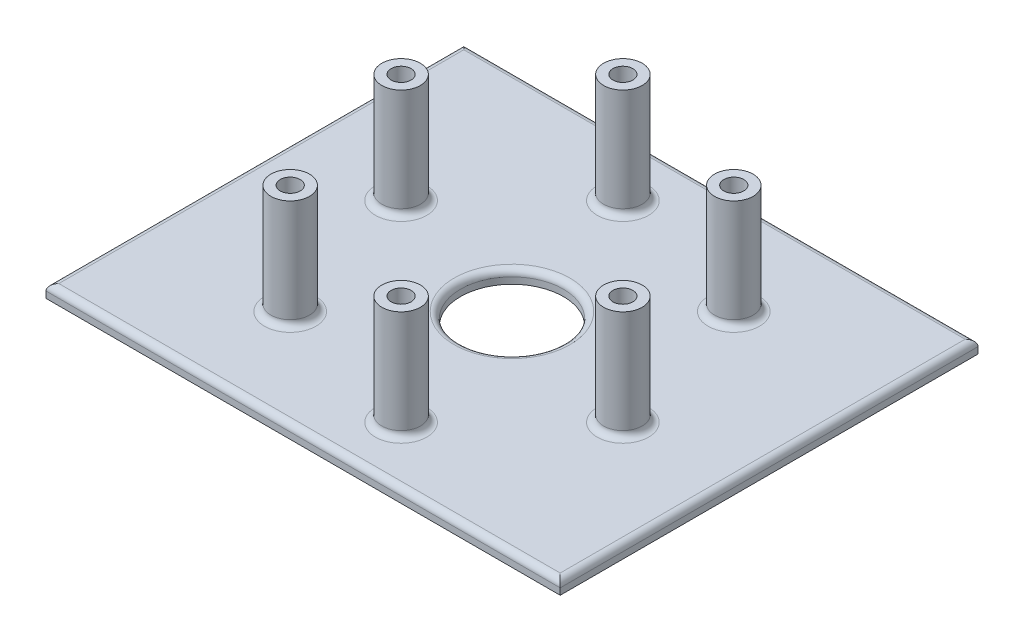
from build123d import *

# Parameters (mm, degrees)
SKETCH1_W                = 80
SKETCH1_H                = 65
BOSS_EXTRUDE1_DEPTH      = 2
SKETCH3_R                = 3
BOSS_EXTRUDE2_DEPTH      = 17
SKETCH4_R                = 1.55
CUT_EXTRUDE1_DEPTH       = 5
FILLET1_R                = 1
CIRPATTERN1_COUNT        = 6
FILLET1_OF_CIRPATTERN1_R = 1
SKETCH5_R                = 8
CUT_EXTRUDE2_DEPTH       = 55.270157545
FILLET2_R                = 1


with BuildPart() as part:
    # Sketch1 → Boss-Extrude1 (new body)
    with BuildSketch(Plane(origin=(0, 0, 0), x_dir=(1, 0, 0), z_dir=(0, 1, 0))):
        Rectangle(SKETCH1_W, SKETCH1_H)
    extrude(amount=-BOSS_EXTRUDE1_DEPTH)

    # Sketch3 → Boss-Extrude2 (add)
    with BuildSketch(Plane(origin=(0, 0, 0), x_dir=(1, 0, 0), z_dir=(0, 1, 0))):
        with Locations(Location((17.253405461, 17.253405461, 0), (0, 0, 90))):
            Circle(SKETCH3_R)
    boss_extrude2 = extrude(amount=BOSS_EXTRUDE2_DEPTH)

    # Sketch4 → Cut-Extrude1 (cut)
    with BuildSketch(Plane(origin=(0, 17, 0), x_dir=(1, 0, 0), z_dir=(0, 1, 0))):
        with Locations(Location((17.253405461, 17.253405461, 0), (0, 0, 270))):
            Circle(SKETCH4_R)
    cut_extrude1 = extrude(amount=-CUT_EXTRUDE1_DEPTH, mode=Mode.SUBTRACT)

    # Fillet1
    fillet1_edges = [part.edges().sort_by_distance(p)[0] for p in [
        (17.253405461, 0, -14.253405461),
    ]]
    fillet(fillet1_edges, radius=FILLET1_R)

    # CirPattern1: Boss-Extrude2, Cut-Extrude1 ×6 about axis
    cirpattern1_axis = Axis((0, 0, 0), (0, 1, 0))
    add([boss_extrude2.rotate(cirpattern1_axis, i * 360 / CIRPATTERN1_COUNT) for i in range(1, CIRPATTERN1_COUNT)])
    add([cut_extrude1.rotate(cirpattern1_axis, i * 360 / CIRPATTERN1_COUNT) for i in range(1, CIRPATTERN1_COUNT)], mode=Mode.SUBTRACT)

    # Fillet1 of CirPattern1
    fillet1_of_cirpattern1_edges = [part.edges().sort_by_distance(p)[0] for p in [
        (-3.717108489, 0, -22.068590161),
        (-20.97051395, 0, -7.815184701),
        (-17.253405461, 0, 14.253405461),
        (3.717108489, 0, 22.068590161),
        (20.97051395, 0, 7.815184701),
    ]]
    fillet(fillet1_of_cirpattern1_edges, radius=FILLET1_OF_CIRPATTERN1_R)

    # Sketch5 → Cut-Extrude2 (cut, through all)
    with BuildSketch(Plane(origin=(0, 0, 0), x_dir=(1, 0, 0), z_dir=(0, 1, 0))):
        with Locations(Location((0, 0, 0), (0, 0, 270))):
            Circle(SKETCH5_R)
    extrude(amount=-CUT_EXTRUDE2_DEPTH, mode=Mode.SUBTRACT)

    # Fillet2
    fillet2_edges = [part.edges().sort_by_distance(p)[0] for p in [
        (0, 0, -8),
        (0, 0, 32.5),
        (-40, 0, 0),
        (0, 0, -32.5),
        (40, 0, 0),
    ]]
    fillet(fillet2_edges, radius=FILLET2_R)


solid = part.part
